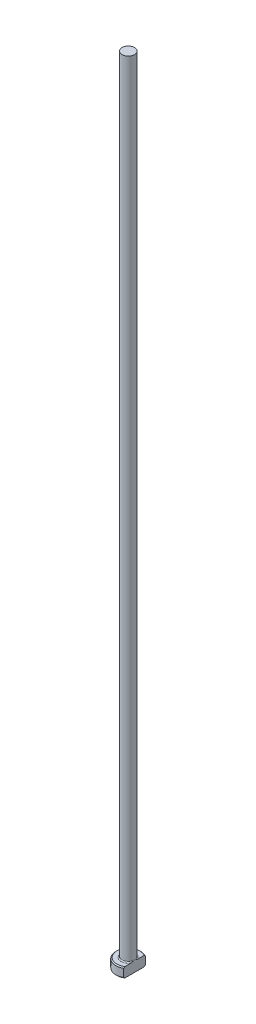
ISO-10303-21;
HEADER;
FILE_DESCRIPTION(('STEP AP214'),'2;1');
FILE_NAME('part.step','',(''),(''),'','','');
FILE_SCHEMA(('AUTOMOTIVE_DESIGN { 1 0 10303 214 1 1 1 1 }'));
ENDSEC;
DATA;
#1=APPLICATION_CONTEXT('core data for automotive mechanical design processes');
#2=APPLICATION_PROTOCOL_DEFINITION('international standard','automotive_design',2000,#1);
#3=PRODUCT_CONTEXT('',#1,'mechanical');
#4=PRODUCT('Part','Part','',(#3));
#5=PRODUCT_RELATED_PRODUCT_CATEGORY('part','',(#4));
#6=PRODUCT_DEFINITION_FORMATION('','',#4);
#7=PRODUCT_DEFINITION_CONTEXT('part definition',#1,'design');
#8=PRODUCT_DEFINITION('design','',#6,#7);
#9=PRODUCT_DEFINITION_SHAPE('','',#8);
#10=(LENGTH_UNIT() NAMED_UNIT(*) SI_UNIT(.MILLI.,.METRE.));
#11=(NAMED_UNIT(*) PLANE_ANGLE_UNIT() SI_UNIT($,.RADIAN.));
#12=(NAMED_UNIT(*) SI_UNIT($,.STERADIAN.) SOLID_ANGLE_UNIT());
#13=UNCERTAINTY_MEASURE_WITH_UNIT(LENGTH_MEASURE(1.E-05),#10,'distance_accuracy_value','');
#14=(GEOMETRIC_REPRESENTATION_CONTEXT(3) GLOBAL_UNCERTAINTY_ASSIGNED_CONTEXT((#13)) GLOBAL_UNIT_ASSIGNED_CONTEXT((#10,
#11,#12)) REPRESENTATION_CONTEXT('',''));
#15=CARTESIAN_POINT('',(0.,0.,0.));
#16=DIRECTION('',(0.,0.,1.));
#17=DIRECTION('',(1.,0.,0.));
#18=AXIS2_PLACEMENT_3D('',#15,#16,#17);
#19=CARTESIAN_POINT('',(0.,0.,0.));
#20=DIRECTION('',(0.,-1.,0.));
#21=DIRECTION('',(0.,0.,-1.));
#22=AXIS2_PLACEMENT_3D('',#19,#20,#21);
#23=PLANE('',#22);
#24=CARTESIAN_POINT('',(0.,0.,0.));
#25=DIRECTION('',(0.,-1.,0.));
#26=DIRECTION('',(0.,0.,-1.));
#27=AXIS2_PLACEMENT_3D('',#24,#25,#26);
#28=CIRCLE('',#27,2.29999999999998);
#29=CARTESIAN_POINT('',(1.24999999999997,0.,1.93067345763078));
#30=VERTEX_POINT('',#29);
#31=CARTESIAN_POINT('',(1.24999999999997,0.,-1.93067345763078));
#32=VERTEX_POINT('',#31);
#33=EDGE_CURVE('E98',#30,#32,#28,.T.);
#34=ORIENTED_EDGE('',*,*,#33,.T.);
#35=DIRECTION('',(0.,0.,1.));
#36=VECTOR('',#35,1.);
#37=CARTESIAN_POINT('',(1.24999999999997,0.,-2.16506350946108));
#38=LINE('',#37,#36);
#39=EDGE_CURVE('E83',#32,#30,#38,.T.);
#40=ORIENTED_EDGE('',*,*,#39,.T.);
#41=EDGE_LOOP('',(#34,#40));
#42=FACE_BOUND('',#41,.T.);
#43=ADVANCED_FACE('F32',(#42),#23,.T.);
#44=CARTESIAN_POINT('',(0.,259.958771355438,0.));
#45=DIRECTION('',(0.,1.,0.));
#46=DIRECTION('',(0.,0.,1.));
#47=AXIS2_PLACEMENT_3D('',#44,#45,#46);
#48=CYLINDRICAL_SURFACE('',#47,2.49999999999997);
#49=CARTESIAN_POINT('',(0.,1.79999999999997,0.));
#50=DIRECTION('',(0.,1.,0.));
#51=DIRECTION('',(0.,0.,1.));
#52=AXIS2_PLACEMENT_3D('',#49,#50,#51);
#53=CIRCLE('',#52,2.49999999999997);
#54=CARTESIAN_POINT('',(1.24999999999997,1.79999999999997,2.16506350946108));
#55=VERTEX_POINT('',#54);
#56=CARTESIAN_POINT('',(1.24999999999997,1.79999999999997,-2.16506350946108));
#57=VERTEX_POINT('',#56);
#58=EDGE_CURVE('E104',#55,#57,#53,.F.);
#59=ORIENTED_EDGE('',*,*,#58,.T.);
#60=DIRECTION('',(0.,-1.,0.));
#61=VECTOR('',#60,1.);
#62=CARTESIAN_POINT('',(1.24999999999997,160.,-2.16506350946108));
#63=LINE('',#62,#61);
#64=CARTESIAN_POINT('',(1.24999999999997,0.199999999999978,-2.16506350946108));
#65=VERTEX_POINT('',#64);
#66=EDGE_CURVE('E183',#57,#65,#63,.T.);
#67=ORIENTED_EDGE('',*,*,#66,.T.);
#68=CARTESIAN_POINT('',(0.,0.199999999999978,0.));
#69=DIRECTION('',(0.,-1.,0.));
#70=DIRECTION('',(0.,0.,-1.));
#71=AXIS2_PLACEMENT_3D('',#68,#69,#70);
#72=CIRCLE('',#71,2.49999999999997);
#73=CARTESIAN_POINT('',(1.24999999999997,0.199999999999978,2.16506350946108));
#74=VERTEX_POINT('',#73);
#75=EDGE_CURVE('E100',#65,#74,#72,.F.);
#76=ORIENTED_EDGE('',*,*,#75,.T.);
#77=DIRECTION('',(0.,-1.,0.));
#78=VECTOR('',#77,1.);
#79=CARTESIAN_POINT('',(1.24999999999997,160.,2.16506350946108));
#80=LINE('',#79,#78);
#81=EDGE_CURVE('E93',#55,#74,#80,.T.);
#82=ORIENTED_EDGE('',*,*,#81,.F.);
#83=EDGE_LOOP('',(#59,#67,#76,#82));
#84=FACE_BOUND('',#83,.T.);
#85=ADVANCED_FACE('F158',(#84),#48,.T.);
#86=CARTESIAN_POINT('',(-2.49999999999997,2.,0.));
#87=DIRECTION('',(0.,1.,0.));
#88=DIRECTION('',(0.,0.,1.));
#89=AXIS2_PLACEMENT_3D('',#86,#87,#88);
#90=PLANE('',#89);
#91=CARTESIAN_POINT('',(0.,2.,0.));
#92=DIRECTION('',(0.,1.,0.));
#93=DIRECTION('',(0.,0.,1.));
#94=AXIS2_PLACEMENT_3D('',#91,#92,#93);
#95=CIRCLE('',#94,2.29999999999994);
#96=CARTESIAN_POINT('',(1.24999999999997,2.,-1.93067345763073));
#97=VERTEX_POINT('',#96);
#98=CARTESIAN_POINT('',(1.24999999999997,2.,1.93067345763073));
#99=VERTEX_POINT('',#98);
#100=EDGE_CURVE('E178',#97,#99,#95,.T.);
#101=ORIENTED_EDGE('',*,*,#100,.T.);
#102=DIRECTION('',(0.,0.,-1.));
#103=VECTOR('',#102,1.);
#104=CARTESIAN_POINT('',(1.24999999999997,2.,0.));
#105=LINE('',#104,#103);
#106=CARTESIAN_POINT('',(1.24999999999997,1.99999999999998,0.73484692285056));
#107=VERTEX_POINT('',#106);
#108=EDGE_CURVE('E57',#99,#107,#105,.T.);
#109=ORIENTED_EDGE('',*,*,#108,.T.);
#110=CARTESIAN_POINT('',(0.,2.,0.));
#111=DIRECTION('',(0.,1.,0.));
#112=DIRECTION('',(0.,0.,1.));
#113=AXIS2_PLACEMENT_3D('',#110,#111,#112);
#114=CIRCLE('',#113,1.44999999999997);
#115=CARTESIAN_POINT('',(1.24999999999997,1.99999999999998,-0.734846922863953));
#116=VERTEX_POINT('',#115);
#117=EDGE_CURVE('E107',#107,#116,#114,.F.);
#118=ORIENTED_EDGE('',*,*,#117,.T.);
#119=EDGE_CURVE('E136',#116,#97,#105,.T.);
#120=ORIENTED_EDGE('',*,*,#119,.T.);
#121=EDGE_LOOP('',(#101,#109,#118,#120));
#122=FACE_BOUND('',#121,.T.);
#123=ADVANCED_FACE('F147',(#122),#90,.T.);
#124=CARTESIAN_POINT('',(0.,2.,0.));
#125=DIRECTION('',(0.,-1.,0.));
#126=DIRECTION('',(0.,0.,-1.));
#127=AXIS2_PLACEMENT_3D('',#124,#125,#126);
#128=CONICAL_SURFACE('',#127,2.29999999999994,0.785398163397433);
#129=ORIENTED_EDGE('',*,*,#58,.F.);
#130=CARTESIAN_POINT('',(1.24999999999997,-0.627301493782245,4.76610952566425));
#131=CARTESIAN_POINT('',(1.24999999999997,-0.522786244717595,4.6580533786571));
#132=CARTESIAN_POINT('',(1.24999999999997,-0.418383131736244,4.54988840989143));
#133=CARTESIAN_POINT('',(1.24999999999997,-0.209867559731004,4.33327605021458));
#134=CARTESIAN_POINT('',(1.24999999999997,-0.105755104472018,4.22482865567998));
#135=CARTESIAN_POINT('',(1.24999999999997,0.102163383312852,4.00753373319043));
#136=CARTESIAN_POINT('',(1.24999999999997,0.205969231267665,3.89868602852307));
#137=CARTESIAN_POINT('',(1.24999999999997,0.413121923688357,3.68055575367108));
#138=CARTESIAN_POINT('',(1.24999999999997,0.516468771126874,3.57127318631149));
#139=CARTESIAN_POINT('',(1.24999999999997,0.72052253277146,3.35432408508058));
#140=CARTESIAN_POINT('',(1.24999999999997,0.821241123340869,3.24666854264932));
#141=CARTESIAN_POINT('',(1.24999999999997,1.02192410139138,3.03065701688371));
#142=CARTESIAN_POINT('',(1.24999999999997,1.12188849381,2.92230103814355));
#143=CARTESIAN_POINT('',(1.24999999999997,1.32077037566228,2.70467415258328));
#144=CARTESIAN_POINT('',(1.24999999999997,1.41968808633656,2.59540344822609));
#145=CARTESIAN_POINT('',(1.24999999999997,1.61608273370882,2.37557697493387));
#146=CARTESIAN_POINT('',(1.24999999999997,1.71355972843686,2.26502125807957));
#147=CARTESIAN_POINT('',(1.24999999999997,1.86911393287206,2.08515617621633));
#148=CARTESIAN_POINT('',(1.24999999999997,1.92785594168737,2.01642247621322));
#149=CARTESIAN_POINT('',(1.24999999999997,2.04429378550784,1.8780605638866));
#150=CARTESIAN_POINT('',(1.24999999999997,2.10198951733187,1.80843226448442));
#151=CARTESIAN_POINT('',(1.24999999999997,2.21658041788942,1.66728976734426));
#152=CARTESIAN_POINT('',(1.24999999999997,2.27346067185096,1.59576341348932));
#153=CARTESIAN_POINT('',(1.24999999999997,2.38522965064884,1.45118948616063));
#154=CARTESIAN_POINT('',(1.24999999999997,2.44011885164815,1.37814228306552));
#155=CARTESIAN_POINT('',(1.24999999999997,2.54788773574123,1.22886697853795));
#156=CARTESIAN_POINT('',(1.24999999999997,2.60072420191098,1.15260740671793));
#157=CARTESIAN_POINT('',(1.24999999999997,2.70212030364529,0.997098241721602));
#158=CARTESIAN_POINT('',(1.24999999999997,2.75067405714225,0.917844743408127));
#159=CARTESIAN_POINT('',(1.24999999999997,2.84043729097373,0.756494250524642));
#160=CARTESIAN_POINT('',(1.24999999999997,2.88173033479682,0.674444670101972));
#161=CARTESIAN_POINT('',(1.24999999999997,2.95366083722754,0.505835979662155));
#162=CARTESIAN_POINT('',(1.24999999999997,2.98433405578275,0.419293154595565));
#163=CARTESIAN_POINT('',(1.24999999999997,3.01753107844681,0.289507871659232));
#164=CARTESIAN_POINT('',(1.24999999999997,3.02633539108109,0.247870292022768));
#165=CARTESIAN_POINT('',(1.24999999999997,3.03997448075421,0.163937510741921));
#166=CARTESIAN_POINT('',(1.24999999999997,3.04480960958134,0.121642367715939));
#167=CARTESIAN_POINT('',(1.24999999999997,3.05016786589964,0.0369068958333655));
#168=CARTESIAN_POINT('',(1.24999999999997,3.05070431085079,-0.00553257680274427));
#169=CARTESIAN_POINT('',(1.24999999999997,3.04746162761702,-0.0902467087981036));
#170=CARTESIAN_POINT('',(1.24999999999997,3.04368214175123,-0.132521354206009));
#171=CARTESIAN_POINT('',(1.24999999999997,3.03212264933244,-0.216135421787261));
#172=CARTESIAN_POINT('',(1.24999999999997,3.02437758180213,-0.257479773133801));
#173=CARTESIAN_POINT('',(1.24999999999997,3.0053673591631,-0.33935443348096));
#174=CARTESIAN_POINT('',(1.24999999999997,2.99410082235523,-0.379884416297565));
#175=CARTESIAN_POINT('',(1.24999999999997,2.96852211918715,-0.460209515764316));
#176=CARTESIAN_POINT('',(1.24999999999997,2.95419322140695,-0.49999923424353));
#177=CARTESIAN_POINT('',(1.24999999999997,2.92306392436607,-0.578577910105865));
#178=CARTESIAN_POINT('',(1.24999999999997,2.9062640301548,-0.617367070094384));
#179=CARTESIAN_POINT('',(1.24999999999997,2.85269034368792,-0.732719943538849));
#180=CARTESIAN_POINT('',(1.24999999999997,2.81287978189,-0.807869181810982));
#181=CARTESIAN_POINT('',(1.24999999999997,2.72799210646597,-0.955157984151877));
#182=CARTESIAN_POINT('',(1.24999999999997,2.68290855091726,-1.02729371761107));
#183=CARTESIAN_POINT('',(1.24999999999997,2.58903993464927,-1.16950551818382));
#184=CARTESIAN_POINT('',(1.24999999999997,2.54024093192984,-1.23957230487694));
#185=CARTESIAN_POINT('',(1.24999999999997,2.44021824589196,-1.37788366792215));
#186=CARTESIAN_POINT('',(1.24999999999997,2.38899576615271,-1.44612912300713));
#187=CARTESIAN_POINT('',(1.24999999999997,2.28411092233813,-1.58215279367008));
#188=CARTESIAN_POINT('',(1.24999999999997,2.23042529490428,-1.64991298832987));
#189=CARTESIAN_POINT('',(1.24999999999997,2.12172412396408,-1.7843605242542));
#190=CARTESIAN_POINT('',(1.24999999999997,2.06670849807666,-1.85104779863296));
#191=CARTESIAN_POINT('',(1.24999999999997,1.90044437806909,-2.04954410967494));
#192=CARTESIAN_POINT('',(1.24999999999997,1.78772044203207,-2.1801152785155));
#193=CARTESIAN_POINT('',(1.24999999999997,1.57927088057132,-2.41711311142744));
#194=CARTESIAN_POINT('',(1.24999999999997,1.48391557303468,-2.52386864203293));
#195=CARTESIAN_POINT('',(1.24999999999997,1.29202937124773,-2.73632311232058));
#196=CARTESIAN_POINT('',(1.24999999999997,1.19549844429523,-2.84202202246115));
#197=CARTESIAN_POINT('',(1.24999999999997,0.904469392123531,-3.15815976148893));
#198=CARTESIAN_POINT('',(1.24999999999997,0.70871394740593,-3.36743889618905));
#199=CARTESIAN_POINT('',(1.24999999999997,0.323382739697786,-3.77561196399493));
#200=CARTESIAN_POINT('',(1.24999999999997,0.133884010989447,-3.97457897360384));
#201=CARTESIAN_POINT('',(1.24999999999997,-0.151120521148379,-4.27209258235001));
#202=CARTESIAN_POINT('',(1.24999999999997,-0.246194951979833,-4.37105278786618));
#203=CARTESIAN_POINT('',(1.24999999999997,-0.436581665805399,-4.56874260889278));
#204=CARTESIAN_POINT('',(1.24999999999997,-0.531893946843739,-4.66747222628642));
#205=CARTESIAN_POINT('',(1.24999999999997,-0.627301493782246,-4.76610952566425));
#206=B_SPLINE_CURVE_WITH_KNOTS('',3,(#130,#131,#132,#133,#134,#135,#136,#137,#138,#139,#140,
#141,#142,#143,#144,#145,#146,#147,#148,#149,#150,#151,#152,#153,#154,#155,#156,#157,#158,#159,
#160,#161,#162,#163,#164,#165,#166,#167,#168,#169,#170,#171,#172,#173,#174,#175,#176,#177,#178,
#179,#180,#181,#182,#183,#184,#185,#186,#187,#188,#189,#190,#191,#192,#193,#194,#195,#196,#197,
#198,#199,#200,#201,#202,#203,#204,#205),.UNSPECIFIED.,.F.,.F.,(4,2,2,2,2,2,2,2,2,2,2,2,2,2,2,2,
2,2,2,2,2,2,2,2,2,2,2,2,2,2,2,2,2,2,2,2,2,4),(0.,0.450994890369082,0.901995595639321,
1.35322763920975,1.80445675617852,2.24672733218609,2.6889950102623,3.1311672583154,
3.57332164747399,3.8445601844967,4.11582532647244,4.38995864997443,4.66402597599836,
4.94225842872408,5.22086725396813,5.49602313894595,5.77024327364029,5.89775644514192,
6.02525831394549,6.15236502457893,6.27948226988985,6.40549833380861,6.531563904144,
6.65833670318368,6.78508362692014,7.03983854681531,7.2949080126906,7.55098686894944,
7.80693985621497,8.06626716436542,8.32561057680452,8.84304654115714,9.27246240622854,
9.70189024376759,10.5615524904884,11.385852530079,11.7975442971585,12.2092326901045),.UNSPECIFIED.);
#207=EDGE_CURVE('E135',#55,#99,#206,.T.);
#208=ORIENTED_EDGE('',*,*,#207,.T.);
#209=ORIENTED_EDGE('',*,*,#100,.F.);
#210=EDGE_CURVE('E127',#97,#57,#206,.T.);
#211=ORIENTED_EDGE('',*,*,#210,.T.);
#212=EDGE_LOOP('',(#129,#208,#209,#211));
#213=FACE_BOUND('',#212,.T.);
#214=ADVANCED_FACE('F143',(#213),#128,.T.);
#215=CARTESIAN_POINT('',(0.,0.199999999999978,0.));
#216=DIRECTION('',(0.,1.,0.));
#217=DIRECTION('',(0.,0.,1.));
#218=AXIS2_PLACEMENT_3D('',#215,#216,#217);
#219=CONICAL_SURFACE('',#218,2.49999999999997,0.785398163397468);
#220=ORIENTED_EDGE('',*,*,#75,.F.);
#221=CARTESIAN_POINT('',(1.24999999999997,2.62730149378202,-4.76610952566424));
#222=CARTESIAN_POINT('',(1.24999999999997,2.52278624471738,-4.65805337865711));
#223=CARTESIAN_POINT('',(1.24999999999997,2.41838313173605,-4.54988840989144));
#224=CARTESIAN_POINT('',(1.24999999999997,2.20986755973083,-4.3332760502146));
#225=CARTESIAN_POINT('',(1.24999999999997,2.10575510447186,-4.22482865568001));
#226=CARTESIAN_POINT('',(1.24999999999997,1.89783661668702,-4.00753373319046));
#227=CARTESIAN_POINT('',(1.24999999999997,1.79403076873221,-3.89868602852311));
#228=CARTESIAN_POINT('',(1.24999999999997,1.58687807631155,-3.68055575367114));
#229=CARTESIAN_POINT('',(1.24999999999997,1.48353122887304,-3.57127318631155));
#230=CARTESIAN_POINT('',(1.24999999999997,1.27947746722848,-3.35432408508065));
#231=CARTESIAN_POINT('',(1.24999999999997,1.17875887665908,-3.2466685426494));
#232=CARTESIAN_POINT('',(1.24999999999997,0.978075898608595,-3.0306570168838));
#233=CARTESIAN_POINT('',(1.24999999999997,0.878111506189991,-2.92230103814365));
#234=CARTESIAN_POINT('',(1.24999999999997,0.679229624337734,-2.70467415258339));
#235=CARTESIAN_POINT('',(1.24999999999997,0.580311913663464,-2.5954034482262));
#236=CARTESIAN_POINT('',(1.24999999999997,0.383917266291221,-2.375576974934));
#237=CARTESIAN_POINT('',(1.24999999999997,0.28644027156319,-2.2650212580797));
#238=CARTESIAN_POINT('',(1.24999999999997,0.130886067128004,-2.08515617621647));
#239=CARTESIAN_POINT('',(1.24999999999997,0.0721440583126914,-2.01642247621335));
#240=CARTESIAN_POINT('',(1.24999999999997,-0.0442937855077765,-1.87806056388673));
#241=CARTESIAN_POINT('',(1.24999999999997,-0.101989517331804,-1.80843226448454));
#242=CARTESIAN_POINT('',(1.24999999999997,-0.216580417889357,-1.66728976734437));
#243=CARTESIAN_POINT('',(1.24999999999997,-0.273460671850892,-1.59576341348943));
#244=CARTESIAN_POINT('',(1.24999999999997,-0.385229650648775,-1.45118948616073));
#245=CARTESIAN_POINT('',(1.24999999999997,-0.440118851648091,-1.37814228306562));
#246=CARTESIAN_POINT('',(1.24999999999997,-0.547887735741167,-1.22886697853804));
#247=CARTESIAN_POINT('',(1.24999999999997,-0.600724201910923,-1.15260740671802));
#248=CARTESIAN_POINT('',(1.24999999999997,-0.702120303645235,-0.997098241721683));
#249=CARTESIAN_POINT('',(1.24999999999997,-0.750674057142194,-0.917844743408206));
#250=CARTESIAN_POINT('',(1.24999999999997,-0.840437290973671,-0.756494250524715));
#251=CARTESIAN_POINT('',(1.24999999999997,-0.881730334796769,-0.674444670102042));
#252=CARTESIAN_POINT('',(1.24999999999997,-0.953660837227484,-0.505835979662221));
#253=CARTESIAN_POINT('',(1.24999999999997,-0.984334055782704,-0.419293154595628));
#254=CARTESIAN_POINT('',(1.24999999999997,-1.01753107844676,-0.289507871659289));
#255=CARTESIAN_POINT('',(1.24999999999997,-1.02633539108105,-0.247870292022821));
#256=CARTESIAN_POINT('',(1.24999999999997,-1.03997448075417,-0.163937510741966));
#257=CARTESIAN_POINT('',(1.24999999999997,-1.0448096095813,-0.121642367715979));
#258=CARTESIAN_POINT('',(1.24999999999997,-1.05016786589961,-0.0369068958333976));
#259=CARTESIAN_POINT('',(1.24999999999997,-1.05070431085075,0.00553257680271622));
#260=CARTESIAN_POINT('',(1.24999999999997,-1.04746162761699,0.0902467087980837));
#261=CARTESIAN_POINT('',(1.24999999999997,-1.0436821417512,0.132521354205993));
#262=CARTESIAN_POINT('',(1.24999999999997,-1.03212264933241,0.216135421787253));
#263=CARTESIAN_POINT('',(1.24999999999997,-1.0243775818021,0.257479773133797));
#264=CARTESIAN_POINT('',(1.24999999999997,-1.00536735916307,0.339354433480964));
#265=CARTESIAN_POINT('',(1.24999999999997,-0.994100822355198,0.379884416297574));
#266=CARTESIAN_POINT('',(1.24999999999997,-0.968522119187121,0.460209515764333));
#267=CARTESIAN_POINT('',(1.24999999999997,-0.954193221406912,0.499999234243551));
#268=CARTESIAN_POINT('',(1.24999999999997,-0.92306392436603,0.578577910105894));
#269=CARTESIAN_POINT('',(1.24999999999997,-0.906264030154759,0.617367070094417));
#270=CARTESIAN_POINT('',(1.24999999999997,-0.852690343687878,0.732719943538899));
#271=CARTESIAN_POINT('',(1.24999999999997,-0.812879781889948,0.807869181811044));
#272=CARTESIAN_POINT('',(1.24999999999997,-0.727992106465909,0.955157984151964));
#273=CARTESIAN_POINT('',(1.24999999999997,-0.682908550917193,1.02729371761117));
#274=CARTESIAN_POINT('',(1.24999999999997,-0.589039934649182,1.16950551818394));
#275=CARTESIAN_POINT('',(1.24999999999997,-0.540240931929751,1.23957230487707));
#276=CARTESIAN_POINT('',(1.24999999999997,-0.440218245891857,1.3778836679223));
#277=CARTESIAN_POINT('',(1.24999999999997,-0.388995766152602,1.44612912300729));
#278=CARTESIAN_POINT('',(1.24999999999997,-0.284110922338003,1.58215279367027));
#279=CARTESIAN_POINT('',(1.24999999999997,-0.230425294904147,1.64991298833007));
#280=CARTESIAN_POINT('',(1.24999999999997,-0.121724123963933,1.78436052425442));
#281=CARTESIAN_POINT('',(1.24999999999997,-0.0667084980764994,1.8510477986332));
#282=CARTESIAN_POINT('',(1.24999999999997,0.0995556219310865,2.0495441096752));
#283=CARTESIAN_POINT('',(1.24999999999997,0.212279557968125,2.18011527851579));
#284=CARTESIAN_POINT('',(1.24999999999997,0.420729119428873,2.41711311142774));
#285=CARTESIAN_POINT('',(1.24999999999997,0.516084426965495,2.5238686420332));
#286=CARTESIAN_POINT('',(1.24999999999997,0.707970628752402,2.73632311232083));
#287=CARTESIAN_POINT('',(1.24999999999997,0.80450155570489,2.84202202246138));
#288=CARTESIAN_POINT('',(1.24999999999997,1.09553060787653,3.15815976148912));
#289=CARTESIAN_POINT('',(1.24999999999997,1.29128605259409,3.36743889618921));
#290=CARTESIAN_POINT('',(1.24999999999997,1.67661726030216,3.77561196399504));
#291=CARTESIAN_POINT('',(1.24999999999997,1.86611598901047,3.97457897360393));
#292=CARTESIAN_POINT('',(1.24999999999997,2.15112052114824,4.27209258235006));
#293=CARTESIAN_POINT('',(1.24999999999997,2.24619495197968,4.37105278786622));
#294=CARTESIAN_POINT('',(1.24999999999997,2.43658166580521,4.5687426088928));
#295=CARTESIAN_POINT('',(1.24999999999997,2.53189394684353,4.66747222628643));
#296=CARTESIAN_POINT('',(1.24999999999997,2.62730149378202,4.76610952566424));
#297=B_SPLINE_CURVE_WITH_KNOTS('',3,(#221,#222,#223,#224,#225,#226,#227,#228,#229,#230,#231,
#232,#233,#234,#235,#236,#237,#238,#239,#240,#241,#242,#243,#244,#245,#246,#247,#248,#249,#250,
#251,#252,#253,#254,#255,#256,#257,#258,#259,#260,#261,#262,#263,#264,#265,#266,#267,#268,#269,
#270,#271,#272,#273,#274,#275,#276,#277,#278,#279,#280,#281,#282,#283,#284,#285,#286,#287,#288,
#289,#290,#291,#292,#293,#294,#295,#296),.UNSPECIFIED.,.F.,.F.,(4,2,2,2,2,2,2,2,2,2,2,2,2,2,2,2,
2,2,2,2,2,2,2,2,2,2,2,2,2,2,2,2,2,2,2,2,2,4),(0.,0.450994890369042,0.901995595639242,
1.35322763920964,1.80445675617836,2.2467273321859,2.68899501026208,3.13116725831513,
3.57332164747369,3.84456018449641,4.11582532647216,4.38995864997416,4.66402597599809,
4.94225842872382,5.22086725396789,5.49602313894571,5.77024327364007,5.89775644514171,
6.02525831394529,6.15236502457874,6.27948226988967,6.40549833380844,6.53156390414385,
6.65833670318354,6.78508362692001,7.03983854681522,7.29490801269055,7.55098686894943,
7.806939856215,8.06626716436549,8.32561057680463,8.84304654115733,9.27246240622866,
9.70189024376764,10.5615524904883,11.3858525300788,11.7975442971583,12.2092326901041),.UNSPECIFIED.);
#298=EDGE_CURVE('E86',#65,#32,#297,.T.);
#299=ORIENTED_EDGE('',*,*,#298,.T.);
#300=ORIENTED_EDGE('',*,*,#33,.F.);
#301=EDGE_CURVE('E89',#30,#74,#297,.T.);
#302=ORIENTED_EDGE('',*,*,#301,.T.);
#303=EDGE_LOOP('',(#220,#299,#300,#302));
#304=FACE_BOUND('',#303,.T.);
#305=ADVANCED_FACE('F97',(#304),#219,.T.);
#306=CARTESIAN_POINT('',(0.,2.19999999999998,0.));
#307=DIRECTION('',(0.,1.,0.));
#308=DIRECTION('',(0.,0.,1.));
#309=AXIS2_PLACEMENT_3D('',#306,#307,#308);
#310=TOROIDAL_SURFACE('',#309,1.44999999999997,0.2);
#311=CARTESIAN_POINT('',(1.24999999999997,2.19999999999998,0.));
#312=CARTESIAN_POINT('',(1.24999999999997,2.20000051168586,-1.9767961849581E-10));
#313=CARTESIAN_POINT('',(1.24999999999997,2.20000102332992,-1.08908063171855E-07));
#314=CARTESIAN_POINT('',(1.24999999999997,2.20000200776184,-4.52594759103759E-07));
#315=CARTESIAN_POINT('',(1.24999999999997,2.20000247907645,-6.90993033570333E-07));
#316=CARTESIAN_POINT('',(1.24999999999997,2.20000341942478,-1.26357942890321E-06));
#317=CARTESIAN_POINT('',(1.24999999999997,2.20000388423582,-1.60457617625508E-06));
#318=CARTESIAN_POINT('',(1.24999999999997,2.20000476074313,-2.3395489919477E-06));
#319=CARTESIAN_POINT('',(1.24999999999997,2.20000517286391,-2.7330414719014E-06));
#320=CARTESIAN_POINT('',(1.24999999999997,2.20000655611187,-4.14544010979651E-06));
#321=CARTESIAN_POINT('',(1.24999999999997,2.20000745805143,-5.23310089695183E-06));
#322=CARTESIAN_POINT('',(1.24999999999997,2.20000906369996,-7.47950358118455E-06));
#323=CARTESIAN_POINT('',(1.24999999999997,2.20000977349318,-8.63414435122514E-06));
#324=CARTESIAN_POINT('',(1.24999999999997,2.20001244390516,-1.31453476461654E-05));
#325=CARTESIAN_POINT('',(1.24999999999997,2.20001426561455,-1.65880555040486E-05));
#326=CARTESIAN_POINT('',(1.24999999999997,2.20001724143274,-2.33729028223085E-05));
#327=CARTESIAN_POINT('',(1.24999999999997,2.20001844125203,-2.66956153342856E-05));
#328=CARTESIAN_POINT('',(1.24999999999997,2.2000235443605,-4.08635084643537E-05));
#329=CARTESIAN_POINT('',(1.24999999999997,2.20002741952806,-5.17114612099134E-05));
#330=CARTESIAN_POINT('',(1.24999999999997,2.20003363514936,-7.20057670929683E-05));
#331=CARTESIAN_POINT('',(1.24999999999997,2.20003612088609,-8.14057063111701E-05));
#332=CARTESIAN_POINT('',(1.24999999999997,2.20005581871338,-0.000149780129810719));
#333=CARTESIAN_POINT('',(1.24999999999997,2.20008094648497,-0.000206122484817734));
#334=CARTESIAN_POINT('',(1.24999999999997,2.20017507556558,-0.000425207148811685));
#335=CARTESIAN_POINT('',(1.24999999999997,2.20023819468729,-0.000589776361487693));
#336=CARTESIAN_POINT('',(1.24999999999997,2.20048692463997,-0.00122878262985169));
#337=CARTESIAN_POINT('',(1.24999999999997,2.20067870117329,-0.00170134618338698));
#338=CARTESIAN_POINT('',(1.24999999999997,2.20146022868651,-0.00363636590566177));
#339=CARTESIAN_POINT('',(1.24999999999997,2.20204298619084,-0.00510090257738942));
#340=CARTESIAN_POINT('',(1.24999999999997,2.20939719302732,-0.0235712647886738));
#341=CARTESIAN_POINT('',(1.24999999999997,2.21621259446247,-0.0405643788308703));
#342=CARTESIAN_POINT('',(1.24999999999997,2.22951000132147,-0.0739606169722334));
#343=CARTESIAN_POINT('',(1.24999999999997,2.23599508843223,-0.0903626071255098));
#344=CARTESIAN_POINT('',(1.24999999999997,2.24961430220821,-0.12511129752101));
#345=CARTESIAN_POINT('',(1.24999999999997,2.25673641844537,-0.143462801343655));
#346=CARTESIAN_POINT('',(1.24999999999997,2.27085039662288,-0.180427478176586));
#347=CARTESIAN_POINT('',(1.24999999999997,2.27784022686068,-0.199041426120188));
#348=CARTESIAN_POINT('',(1.24999999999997,2.29479134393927,-0.245221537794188));
#349=CARTESIAN_POINT('',(1.24999999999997,2.30459026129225,-0.272848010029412));
#350=CARTESIAN_POINT('',(1.24999999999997,2.32310234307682,-0.327738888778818));
#351=CARTESIAN_POINT('',(1.24999999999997,2.33183568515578,-0.354996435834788));
#352=CARTESIAN_POINT('',(1.24999999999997,2.3493656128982,-0.41374417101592));
#353=CARTESIAN_POINT('',(1.24999999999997,2.35799470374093,-0.445285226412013));
#354=CARTESIAN_POINT('',(1.24999999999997,2.37338463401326,-0.509091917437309));
#355=CARTESIAN_POINT('',(1.24999999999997,2.38013036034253,-0.541361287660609));
#356=CARTESIAN_POINT('',(1.24999999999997,2.39136059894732,-0.608339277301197));
#357=CARTESIAN_POINT('',(1.24999999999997,2.39568167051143,-0.643076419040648));
#358=CARTESIAN_POINT('',(1.24999999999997,2.40037605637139,-0.712733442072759));
#359=CARTESIAN_POINT('',(1.24999999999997,2.40076553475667,-0.747651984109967));
#360=CARTESIAN_POINT('',(1.24999999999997,2.39677668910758,-0.8081037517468));
#361=CARTESIAN_POINT('',(1.24999999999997,2.39361441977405,-0.833711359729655));
#362=CARTESIAN_POINT('',(1.24999999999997,2.38355990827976,-0.883915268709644));
#363=CARTESIAN_POINT('',(1.24999999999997,2.37671813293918,-0.908520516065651));
#364=CARTESIAN_POINT('',(1.24999999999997,2.36252570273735,-0.944879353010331));
#365=CARTESIAN_POINT('',(1.24999999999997,2.35688428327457,-0.957298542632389));
#366=CARTESIAN_POINT('',(1.24999999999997,2.34399066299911,-0.981318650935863));
#367=CARTESIAN_POINT('',(1.24999999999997,2.33673636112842,-0.992918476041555));
#368=CARTESIAN_POINT('',(1.24999999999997,2.32199744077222,-1.01267533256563));
#369=CARTESIAN_POINT('',(1.24999999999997,2.31482723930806,-1.02106482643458));
#370=CARTESIAN_POINT('',(1.24999999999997,2.29924321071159,-1.03659690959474));
#371=CARTESIAN_POINT('',(1.24999999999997,2.29083198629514,-1.04374204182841));
#372=CARTESIAN_POINT('',(1.24999999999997,2.27498600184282,-1.05478694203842));
#373=CARTESIAN_POINT('',(1.24999999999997,2.26780814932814,-1.05905359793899));
#374=CARTESIAN_POINT('',(1.24999999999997,2.25284782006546,-1.06635953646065));
#375=CARTESIAN_POINT('',(1.24999999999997,2.24506572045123,-1.06939957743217));
#376=CARTESIAN_POINT('',(1.24999999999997,2.22901828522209,-1.07404931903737));
#377=CARTESIAN_POINT('',(1.24999999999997,2.22074990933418,-1.07564870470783));
#378=CARTESIAN_POINT('',(1.24999999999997,2.20405985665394,-1.07723717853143));
#379=CARTESIAN_POINT('',(1.24999999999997,2.19563825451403,-1.07722703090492));
#380=CARTESIAN_POINT('',(1.24999999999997,2.17988128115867,-1.07569157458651));
#381=CARTESIAN_POINT('',(1.24999999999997,2.17252879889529,-1.0743339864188));
#382=CARTESIAN_POINT('',(1.24999999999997,2.15814333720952,-1.07044616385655));
#383=CARTESIAN_POINT('',(1.24999999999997,2.15111040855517,-1.06791574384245));
#384=CARTESIAN_POINT('',(1.24999999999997,2.13724955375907,-1.06171920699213));
#385=CARTESIAN_POINT('',(1.24999999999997,2.13043935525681,-1.05801386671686));
#386=CARTESIAN_POINT('',(1.24999999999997,2.11740316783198,-1.04969609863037));
#387=CARTESIAN_POINT('',(1.24999999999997,2.11117742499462,-1.04508329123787));
#388=CARTESIAN_POINT('',(1.24999999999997,2.09586196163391,-1.03220341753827));
#389=CARTESIAN_POINT('',(1.24999999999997,2.08723799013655,-1.02338140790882));
#390=CARTESIAN_POINT('',(1.24999999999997,2.07148817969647,-1.00448021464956));
#391=CARTESIAN_POINT('',(1.24999999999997,2.0643671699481,-0.994397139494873));
#392=CARTESIAN_POINT('',(1.24999999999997,2.04800089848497,-0.967694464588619));
#393=CARTESIAN_POINT('',(1.24999999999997,2.0397014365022,-0.950498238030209));
#394=CARTESIAN_POINT('',(1.24999999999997,2.02582422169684,-0.915117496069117));
#395=CARTESIAN_POINT('',(1.24999999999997,2.02024415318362,-0.896933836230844));
#396=CARTESIAN_POINT('',(1.24999999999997,2.00805724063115,-0.846781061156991));
#397=CARTESIAN_POINT('',(1.24999999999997,2.00359525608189,-0.8142976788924));
#398=CARTESIAN_POINT('',(1.24999999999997,1.99933348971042,-0.748574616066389));
#399=CARTESIAN_POINT('',(1.24999999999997,1.99961552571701,-0.715331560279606));
#400=CARTESIAN_POINT('',(1.24999999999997,2.00446632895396,-0.637920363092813));
#401=CARTESIAN_POINT('',(1.24999999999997,2.01044886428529,-0.593849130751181));
#402=CARTESIAN_POINT('',(1.24999999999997,2.02681929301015,-0.506401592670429));
#403=CARTESIAN_POINT('',(1.24999999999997,2.03722697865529,-0.463029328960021));
#404=CARTESIAN_POINT('',(1.24999999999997,2.06007158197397,-0.380638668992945));
#405=CARTESIAN_POINT('',(1.24999999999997,2.07227412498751,-0.34155342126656));
#406=CARTESIAN_POINT('',(1.24999999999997,2.09824323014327,-0.264347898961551));
#407=CARTESIAN_POINT('',(1.24999999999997,2.11199311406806,-0.226221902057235));
#408=CARTESIAN_POINT('',(1.24999999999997,2.13108825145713,-0.175350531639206));
#409=CARTESIAN_POINT('',(1.24999999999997,2.13599999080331,-0.16243890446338));
#410=CARTESIAN_POINT('',(1.24999999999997,2.14604281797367,-0.13631825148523));
#411=CARTESIAN_POINT('',(1.24999999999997,2.15117629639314,-0.123110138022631));
#412=CARTESIAN_POINT('',(1.24999999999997,2.16341702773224,-0.0918425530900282));
#413=CARTESIAN_POINT('',(1.24999999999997,2.17055250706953,-0.0737943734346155));
#414=CARTESIAN_POINT('',(1.24999999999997,2.18426943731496,-0.0393586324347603));
#415=CARTESIAN_POINT('',(1.24999999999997,2.19084281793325,-0.0229681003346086));
#416=CARTESIAN_POINT('',(1.24999999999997,2.19795564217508,-0.00510438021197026));
#417=CARTESIAN_POINT('',(1.24999999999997,2.19853702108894,-0.00364331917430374));
#418=CARTESIAN_POINT('',(1.24999999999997,2.19931818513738,-0.00170914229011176));
#419=CARTESIAN_POINT('',(1.24999999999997,2.19951102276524,-0.00123396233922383));
#420=CARTESIAN_POINT('',(1.24999999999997,2.19976104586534,-0.000591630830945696));
#421=CARTESIAN_POINT('',(1.24999999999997,2.19982443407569,-0.000426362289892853));
#422=CARTESIAN_POINT('',(1.24999999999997,2.1999189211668,-0.000206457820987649));
#423=CARTESIAN_POINT('',(1.24999999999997,2.19994410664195,-0.000149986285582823));
#424=CARTESIAN_POINT('',(1.24999999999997,2.19996383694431,-8.1464748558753E-05));
#425=CARTESIAN_POINT('',(1.24999999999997,2.19996632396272,-7.20551566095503E-05));
#426=CARTESIAN_POINT('',(1.24999999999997,2.19997254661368,-5.17396175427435E-05));
#427=CARTESIAN_POINT('',(1.24999999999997,2.19997642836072,-4.08803462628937E-05));
#428=CARTESIAN_POINT('',(1.24999999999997,2.19998153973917,-2.66997572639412E-05));
#429=CARTESIAN_POINT('',(1.24999999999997,2.1999827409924,-2.33755457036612E-05));
#430=CARTESIAN_POINT('',(1.24999999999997,2.19998572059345,-1.65878757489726E-05));
#431=CARTESIAN_POINT('',(1.24999999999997,2.19998754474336,-1.31438993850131E-05));
#432=CARTESIAN_POINT('',(1.24999999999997,2.19999021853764,-8.63150510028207E-06));
#433=CARTESIAN_POINT('',(1.24999999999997,2.19999092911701,-7.47674879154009E-06));
#434=CARTESIAN_POINT('',(1.24999999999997,2.19999253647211,-5.23027079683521E-06));
#435=CARTESIAN_POINT('',(1.24999999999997,2.19999343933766,-4.14265820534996E-06));
#436=CARTESIAN_POINT('',(1.24999999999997,2.19999482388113,-2.73051190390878E-06));
#437=CARTESIAN_POINT('',(1.24999999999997,2.19999523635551,-2.33712918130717E-06));
#438=CARTESIAN_POINT('',(1.24999999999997,2.19999611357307,-1.60243917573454E-06));
#439=CARTESIAN_POINT('',(1.24999999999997,2.19999657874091,-1.26161620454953E-06));
#440=CARTESIAN_POINT('',(1.24999999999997,2.19999751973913,-6.89449591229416E-07));
#441=CARTESIAN_POINT('',(1.24999999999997,2.19999799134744,-4.51288697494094E-07));
#442=CARTESIAN_POINT('',(1.24999999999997,2.19999897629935,-1.08178109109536E-07));
#443=CARTESIAN_POINT('',(1.24999999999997,2.19999948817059,1.97735059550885E-10));
#444=CARTESIAN_POINT('',(1.24999999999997,2.19999999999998,0.));
#445=B_SPLINE_CURVE_WITH_KNOTS('',3,(#311,#312,#313,#314,#315,#316,#317,#318,#319,#320,#321,
#322,#323,#324,#325,#326,#327,#328,#329,#330,#331,#332,#333,#334,#335,#336,#337,#338,#339,#340,
#341,#342,#343,#344,#345,#346,#347,#348,#349,#350,#351,#352,#353,#354,#355,#356,#357,#358,#359,
#360,#361,#362,#363,#364,#365,#366,#367,#368,#369,#370,#371,#372,#373,#374,#375,#376,#377,#378,
#379,#380,#381,#382,#383,#384,#385,#386,#387,#388,#389,#390,#391,#392,#393,#394,#395,#396,#397,
#398,#399,#400,#401,#402,#403,#404,#405,#406,#407,#408,#409,#410,#411,#412,#413,#414,#415,#416,
#417,#418,#419,#420,#421,#422,#423,#424,#425,#426,#427,#428,#429,#430,#431,#432,#433,#434,#435,
#436,#437,#438,#439,#440,#441,#442,#443,#444),.UNSPECIFIED.,.T.,.F.,(4,2,2,2,2,2,2,2,2,2,2,2,2,
2,2,2,2,2,2,2,2,2,2,2,2,2,2,2,2,2,2,2,2,2,2,2,2,2,2,2,2,2,2,2,2,2,2,2,2,2,2,2,2,2,2,2,2,2,2,2,2,
2,2,2,2,2,4),(0.,1.53427576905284E-06,3.11115061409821E-06,4.83351643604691E-06,
6.54098955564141E-06,1.07594295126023E-05,1.48222852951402E-05,2.64707315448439E-05,
3.70576290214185E-05,7.16088727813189E-05,0.000100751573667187,0.000285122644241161,
0.000814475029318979,0.00234373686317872,0.00707317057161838,0.061994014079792,
0.114907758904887,0.173961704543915,0.233609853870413,0.321537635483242,0.407388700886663,
0.505443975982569,0.604264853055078,0.709126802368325,0.813557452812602,0.890773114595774,
0.966955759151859,1.00778845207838,1.04867465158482,1.08167318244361,1.1146034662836,
1.13955805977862,1.16449720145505,1.18961351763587,1.21471790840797,1.23704542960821,
1.25937648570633,1.28254952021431,1.30573226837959,1.34253218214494,1.37944859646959,
1.43640829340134,1.4933194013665,1.59113685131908,1.69064301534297,1.82371118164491,
1.9573808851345,2.08016146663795,2.20172662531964,2.24316968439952,2.28568093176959,
2.34390494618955,2.39687801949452,2.40159623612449,2.40313396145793,2.40366556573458,
2.40385035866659,2.40387953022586,2.40391411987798,2.40392471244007,2.40393636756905,
2.4039404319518,2.40394465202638,2.40394636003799,2.4039480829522,2.40394966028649,
2.40395119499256),.UNSPECIFIED.);
#446=CARTESIAN_POINT('',(1.24999999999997,2.19999999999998,0.));
#447=VERTEX_POINT('',#446);
#448=EDGE_CURVE('E11',#116,#447,#445,.T.);
#449=ORIENTED_EDGE('',*,*,#448,.F.);
#450=ORIENTED_EDGE('',*,*,#117,.F.);
#451=CARTESIAN_POINT('',(1.24999999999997,2.19999999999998,0.));
#452=CARTESIAN_POINT('',(1.24999999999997,2.1999994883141,1.97679627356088E-10));
#453=CARTESIAN_POINT('',(1.24999999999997,2.19999897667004,1.08908063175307E-07));
#454=CARTESIAN_POINT('',(1.24999999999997,2.19999799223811,4.52594759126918E-07));
#455=CARTESIAN_POINT('',(1.24999999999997,2.19999752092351,6.90993033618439E-07));
#456=CARTESIAN_POINT('',(1.24999999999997,2.19999658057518,1.26357942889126E-06));
#457=CARTESIAN_POINT('',(1.24999999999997,2.19999611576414,1.60457617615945E-06));
#458=CARTESIAN_POINT('',(1.24999999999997,2.19999523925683,2.33954899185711E-06));
#459=CARTESIAN_POINT('',(1.24999999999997,2.19999482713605,2.73304147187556E-06));
#460=CARTESIAN_POINT('',(1.24999999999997,2.19999344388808,4.14544010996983E-06));
#461=CARTESIAN_POINT('',(1.24999999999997,2.19999254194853,5.23310089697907E-06));
#462=CARTESIAN_POINT('',(1.24999999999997,2.1999909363,7.47950358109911E-06));
#463=CARTESIAN_POINT('',(1.24999999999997,2.19999022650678,8.63414435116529E-06));
#464=CARTESIAN_POINT('',(1.24999999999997,2.1999875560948,1.3145347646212E-05));
#465=CARTESIAN_POINT('',(1.24999999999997,2.19998573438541,1.65880555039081E-05));
#466=CARTESIAN_POINT('',(1.24999999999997,2.19998275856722,2.33729028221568E-05));
#467=CARTESIAN_POINT('',(1.24999999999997,2.19998155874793,2.66956153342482E-05));
#468=CARTESIAN_POINT('',(1.24999999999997,2.19997645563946,4.08635084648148E-05));
#469=CARTESIAN_POINT('',(1.24999999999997,2.1999725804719,5.1711461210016E-05));
#470=CARTESIAN_POINT('',(1.24999999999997,2.1999663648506,7.2005767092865E-05));
#471=CARTESIAN_POINT('',(1.24999999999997,2.19996387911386,8.14057063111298E-05));
#472=CARTESIAN_POINT('',(1.24999999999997,2.19994418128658,0.000149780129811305));
#473=CARTESIAN_POINT('',(1.24999999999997,2.19991905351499,0.000206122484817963));
#474=CARTESIAN_POINT('',(1.24999999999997,2.19982492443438,0.000425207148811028));
#475=CARTESIAN_POINT('',(1.24999999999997,2.19976180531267,0.000589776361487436));
#476=CARTESIAN_POINT('',(1.24999999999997,2.19951307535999,0.00122878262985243));
#477=CARTESIAN_POINT('',(1.24999999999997,2.19932129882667,0.00170134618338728));
#478=CARTESIAN_POINT('',(1.24999999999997,2.19853977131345,0.00363636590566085));
#479=CARTESIAN_POINT('',(1.24999999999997,2.19795701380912,0.00510090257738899));
#480=CARTESIAN_POINT('',(1.24999999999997,2.19060280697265,0.0235712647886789));
#481=CARTESIAN_POINT('',(1.24999999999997,2.18378740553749,0.0405643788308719));
#482=CARTESIAN_POINT('',(1.24999999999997,2.17048999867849,0.0739606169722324));
#483=CARTESIAN_POINT('',(1.24999999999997,2.16400491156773,0.0903626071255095));
#484=CARTESIAN_POINT('',(1.24999999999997,2.15038569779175,0.125111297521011));
#485=CARTESIAN_POINT('',(1.24999999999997,2.14326358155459,0.143462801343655));
#486=CARTESIAN_POINT('',(1.24999999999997,2.12914960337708,0.180427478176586));
#487=CARTESIAN_POINT('',(1.24999999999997,2.12215977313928,0.199041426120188));
#488=CARTESIAN_POINT('',(1.24999999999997,2.10520865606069,0.245221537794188));
#489=CARTESIAN_POINT('',(1.24999999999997,2.09540973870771,0.272848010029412));
#490=CARTESIAN_POINT('',(1.24999999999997,2.07689765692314,0.327738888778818));
#491=CARTESIAN_POINT('',(1.24999999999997,2.06816431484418,0.354996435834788));
#492=CARTESIAN_POINT('',(1.24999999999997,2.05063438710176,0.41374417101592));
#493=CARTESIAN_POINT('',(1.24999999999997,2.04200529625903,0.445285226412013));
#494=CARTESIAN_POINT('',(1.24999999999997,2.0266153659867,0.509091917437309));
#495=CARTESIAN_POINT('',(1.24999999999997,2.01986963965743,0.541361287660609));
#496=CARTESIAN_POINT('',(1.24999999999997,2.00863940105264,0.608339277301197));
#497=CARTESIAN_POINT('',(1.24999999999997,2.00431832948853,0.643076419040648));
#498=CARTESIAN_POINT('',(1.24999999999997,1.99962394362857,0.712733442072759));
#499=CARTESIAN_POINT('',(1.24999999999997,1.99923446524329,0.747651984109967));
#500=CARTESIAN_POINT('',(1.24999999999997,2.00322331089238,0.8081037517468));
#501=CARTESIAN_POINT('',(1.24999999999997,2.00638558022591,0.833711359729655));
#502=CARTESIAN_POINT('',(1.24999999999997,2.0164400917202,0.883915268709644));
#503=CARTESIAN_POINT('',(1.24999999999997,2.02328186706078,0.908520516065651));
#504=CARTESIAN_POINT('',(1.24999999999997,2.03747429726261,0.944879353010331));
#505=CARTESIAN_POINT('',(1.24999999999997,2.04311571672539,0.957298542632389));
#506=CARTESIAN_POINT('',(1.24999999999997,2.05600933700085,0.981318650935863));
#507=CARTESIAN_POINT('',(1.24999999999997,2.06326363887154,0.992918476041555));
#508=CARTESIAN_POINT('',(1.24999999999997,2.07800255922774,1.01267533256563));
#509=CARTESIAN_POINT('',(1.24999999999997,2.0851727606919,1.02106482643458));
#510=CARTESIAN_POINT('',(1.24999999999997,2.10075678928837,1.03659690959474));
#511=CARTESIAN_POINT('',(1.24999999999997,2.10916801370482,1.04374204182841));
#512=CARTESIAN_POINT('',(1.24999999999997,2.12501399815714,1.05478694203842));
#513=CARTESIAN_POINT('',(1.24999999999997,2.13219185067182,1.05905359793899));
#514=CARTESIAN_POINT('',(1.24999999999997,2.1471521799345,1.06635953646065));
#515=CARTESIAN_POINT('',(1.24999999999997,2.15493427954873,1.06939957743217));
#516=CARTESIAN_POINT('',(1.24999999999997,2.17098171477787,1.07404931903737));
#517=CARTESIAN_POINT('',(1.24999999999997,2.17925009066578,1.07564870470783));
#518=CARTESIAN_POINT('',(1.24999999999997,2.19594014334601,1.07723717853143));
#519=CARTESIAN_POINT('',(1.24999999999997,2.20436174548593,1.07722703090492));
#520=CARTESIAN_POINT('',(1.24999999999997,2.22011871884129,1.07569157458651));
#521=CARTESIAN_POINT('',(1.24999999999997,2.22747120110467,1.0743339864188));
#522=CARTESIAN_POINT('',(1.24999999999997,2.24185666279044,1.07044616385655));
#523=CARTESIAN_POINT('',(1.24999999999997,2.24888959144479,1.06791574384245));
#524=CARTESIAN_POINT('',(1.24999999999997,2.26275044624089,1.06171920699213));
#525=CARTESIAN_POINT('',(1.24999999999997,2.26956064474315,1.05801386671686));
#526=CARTESIAN_POINT('',(1.24999999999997,2.28259683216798,1.04969609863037));
#527=CARTESIAN_POINT('',(1.24999999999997,2.28882257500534,1.04508329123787));
#528=CARTESIAN_POINT('',(1.24999999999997,2.30413803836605,1.03220341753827));
#529=CARTESIAN_POINT('',(1.24999999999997,2.31276200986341,1.02338140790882));
#530=CARTESIAN_POINT('',(1.24999999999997,2.32851182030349,1.00448021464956));
#531=CARTESIAN_POINT('',(1.24999999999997,2.33563283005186,0.994397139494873));
#532=CARTESIAN_POINT('',(1.24999999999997,2.35199910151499,0.967694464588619));
#533=CARTESIAN_POINT('',(1.24999999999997,2.36029856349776,0.950498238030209));
#534=CARTESIAN_POINT('',(1.24999999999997,2.37417577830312,0.915117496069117));
#535=CARTESIAN_POINT('',(1.24999999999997,2.37975584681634,0.896933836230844));
#536=CARTESIAN_POINT('',(1.24999999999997,2.3919427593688,0.846781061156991));
#537=CARTESIAN_POINT('',(1.24999999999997,2.39640474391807,0.8142976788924));
#538=CARTESIAN_POINT('',(1.24999999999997,2.40066651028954,0.748574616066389));
#539=CARTESIAN_POINT('',(1.24999999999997,2.40038447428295,0.715331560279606));
#540=CARTESIAN_POINT('',(1.24999999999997,2.395533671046,0.637920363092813));
#541=CARTESIAN_POINT('',(1.24999999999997,2.38955113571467,0.593849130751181));
#542=CARTESIAN_POINT('',(1.24999999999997,2.3731807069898,0.506401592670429));
#543=CARTESIAN_POINT('',(1.24999999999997,2.36277302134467,0.463029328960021));
#544=CARTESIAN_POINT('',(1.24999999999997,2.33992841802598,0.380638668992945));
#545=CARTESIAN_POINT('',(1.24999999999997,2.32772587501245,0.34155342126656));
#546=CARTESIAN_POINT('',(1.24999999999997,2.30175676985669,0.264347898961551));
#547=CARTESIAN_POINT('',(1.24999999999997,2.2880068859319,0.226221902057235));
#548=CARTESIAN_POINT('',(1.24999999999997,2.26891174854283,0.175350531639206));
#549=CARTESIAN_POINT('',(1.24999999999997,2.26400000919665,0.162438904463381));
#550=CARTESIAN_POINT('',(1.24999999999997,2.25395718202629,0.13631825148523));
#551=CARTESIAN_POINT('',(1.24999999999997,2.24882370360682,0.123110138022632));
#552=CARTESIAN_POINT('',(1.24999999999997,2.23658297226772,0.091842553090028));
#553=CARTESIAN_POINT('',(1.24999999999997,2.22944749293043,0.0737943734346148));
#554=CARTESIAN_POINT('',(1.24999999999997,2.215730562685,0.0393586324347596));
#555=CARTESIAN_POINT('',(1.24999999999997,2.20915718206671,0.0229681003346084));
#556=CARTESIAN_POINT('',(1.24999999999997,2.20204435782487,0.00510438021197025));
#557=CARTESIAN_POINT('',(1.24999999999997,2.20146297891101,0.00364331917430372));
#558=CARTESIAN_POINT('',(1.24999999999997,2.20068181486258,0.00170914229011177));
#559=CARTESIAN_POINT('',(1.24999999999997,2.20048897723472,0.00123396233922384));
#560=CARTESIAN_POINT('',(1.24999999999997,2.20023895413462,0.000591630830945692));
#561=CARTESIAN_POINT('',(1.24999999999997,2.20017556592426,0.000426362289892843));
#562=CARTESIAN_POINT('',(1.24999999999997,2.20008107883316,0.000206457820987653));
#563=CARTESIAN_POINT('',(1.24999999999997,2.20005589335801,0.000149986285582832));
#564=CARTESIAN_POINT('',(1.24999999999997,2.20003616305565,8.14647485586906E-05));
#565=CARTESIAN_POINT('',(1.24999999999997,2.20003367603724,7.20551566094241E-05));
#566=CARTESIAN_POINT('',(1.24999999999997,2.20002745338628,5.17396175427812E-05));
#567=CARTESIAN_POINT('',(1.24999999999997,2.20002357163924,4.08803462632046E-05));
#568=CARTESIAN_POINT('',(1.24999999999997,2.20001846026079,2.66997572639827E-05));
#569=CARTESIAN_POINT('',(1.24999999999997,2.20001725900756,2.33755457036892E-05));
#570=CARTESIAN_POINT('',(1.24999999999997,2.20001427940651,1.65878757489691E-05));
#571=CARTESIAN_POINT('',(1.24999999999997,2.2000124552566,1.31438993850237E-05));
#572=CARTESIAN_POINT('',(1.24999999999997,2.20000978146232,8.63150510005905E-06));
#573=CARTESIAN_POINT('',(1.24999999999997,2.20000907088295,7.47674879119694E-06));
#574=CARTESIAN_POINT('',(1.24999999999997,2.20000746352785,5.23027079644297E-06));
#575=CARTESIAN_POINT('',(1.24999999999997,2.2000065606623,4.14265820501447E-06));
#576=CARTESIAN_POINT('',(1.24999999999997,2.20000517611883,2.7305119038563E-06));
#577=CARTESIAN_POINT('',(1.24999999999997,2.20000476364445,2.33712918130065E-06));
#578=CARTESIAN_POINT('',(1.24999999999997,2.20000388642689,1.60243917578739E-06));
#579=CARTESIAN_POINT('',(1.24999999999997,2.20000342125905,1.26161620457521E-06));
#580=CARTESIAN_POINT('',(1.24999999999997,2.20000248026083,6.89449591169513E-07));
#581=CARTESIAN_POINT('',(1.24999999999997,2.20000200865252,4.51288697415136E-07));
#582=CARTESIAN_POINT('',(1.24999999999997,2.20000102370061,1.0817810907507E-07));
#583=CARTESIAN_POINT('',(1.24999999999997,2.20000051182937,-1.97735068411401E-10));
#584=CARTESIAN_POINT('',(1.24999999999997,2.19999999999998,0.));
#585=B_SPLINE_CURVE_WITH_KNOTS('',3,(#451,#452,#453,#454,#455,#456,#457,#458,#459,#460,#461,
#462,#463,#464,#465,#466,#467,#468,#469,#470,#471,#472,#473,#474,#475,#476,#477,#478,#479,#480,
#481,#482,#483,#484,#485,#486,#487,#488,#489,#490,#491,#492,#493,#494,#495,#496,#497,#498,#499,
#500,#501,#502,#503,#504,#505,#506,#507,#508,#509,#510,#511,#512,#513,#514,#515,#516,#517,#518,
#519,#520,#521,#522,#523,#524,#525,#526,#527,#528,#529,#530,#531,#532,#533,#534,#535,#536,#537,
#538,#539,#540,#541,#542,#543,#544,#545,#546,#547,#548,#549,#550,#551,#552,#553,#554,#555,#556,
#557,#558,#559,#560,#561,#562,#563,#564,#565,#566,#567,#568,#569,#570,#571,#572,#573,#574,#575,
#576,#577,#578,#579,#580,#581,#582,#583,#584),.UNSPECIFIED.,.T.,.F.,(4,2,2,2,2,2,2,2,2,2,2,2,2,
2,2,2,2,2,2,2,2,2,2,2,2,2,2,2,2,2,2,2,2,2,2,2,2,2,2,2,2,2,2,2,2,2,2,2,2,2,2,2,2,2,2,2,2,2,2,2,2,
2,2,2,2,2,4),(0.,1.53427576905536E-06,3.11115061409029E-06,4.83351643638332E-06,
6.54098955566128E-06,1.07594295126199E-05,1.48222852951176E-05,2.64707315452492E-05,
3.7057629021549E-05,7.16088727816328E-05,0.000100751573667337,0.000285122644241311,
0.00081447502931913,0.00234373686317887,0.00707317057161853,0.0619940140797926,
0.114907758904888,0.173961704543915,0.233609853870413,0.321537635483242,0.407388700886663,
0.50544397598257,0.604264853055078,0.709126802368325,0.813557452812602,0.890773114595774,
0.966955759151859,1.00778845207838,1.04867465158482,1.08167318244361,1.1146034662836,
1.13955805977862,1.16449720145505,1.18961351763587,1.21471790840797,1.23704542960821,
1.25937648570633,1.28254952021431,1.30573226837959,1.34253218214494,1.37944859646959,
1.43640829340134,1.4933194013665,1.59113685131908,1.69064301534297,1.82371118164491,
1.9573808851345,2.08016146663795,2.20172662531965,2.24316968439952,2.28568093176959,
2.34390494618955,2.39687801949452,2.40159623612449,2.40313396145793,2.40366556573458,
2.40385035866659,2.40387953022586,2.40391411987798,2.40392471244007,2.40393636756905,
2.40394043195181,2.40394465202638,2.40394636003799,2.4039480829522,2.40394966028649,
2.40395119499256),.UNSPECIFIED.);
#586=EDGE_CURVE('E46',#447,#107,#585,.T.);
#587=ORIENTED_EDGE('',*,*,#586,.F.);
#588=CARTESIAN_POINT('',(0.,2.19999999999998,0.));
#589=DIRECTION('',(0.,1.,0.));
#590=DIRECTION('',(0.,0.,1.));
#591=AXIS2_PLACEMENT_3D('',#588,#589,#590);
#592=CIRCLE('',#591,1.24999999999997);
#593=EDGE_CURVE('E103',#447,#447,#592,.T.);
#594=ORIENTED_EDGE('',*,*,#593,.F.);
#595=EDGE_LOOP('',(#449,#450,#587,#594));
#596=FACE_BOUND('',#595,.T.);
#597=ADVANCED_FACE('F34',(#596),#310,.F.);
#598=CARTESIAN_POINT('',(0.,259.958771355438,0.));
#599=DIRECTION('',(0.,1.,0.));
#600=DIRECTION('',(0.,0.,1.));
#601=AXIS2_PLACEMENT_3D('',#598,#599,#600);
#602=CYLINDRICAL_SURFACE('',#601,1.24999999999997);
#603=ORIENTED_EDGE('',*,*,#593,.T.);
#604=EDGE_LOOP('',(#603));
#605=FACE_BOUND('',#604,.T.);
#606=CARTESIAN_POINT('',(0.,160.,0.));
#607=DIRECTION('',(0.,1.,0.));
#608=DIRECTION('',(0.,0.,1.));
#609=AXIS2_PLACEMENT_3D('',#606,#607,#608);
#610=CIRCLE('',#609,1.24999999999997);
#611=CARTESIAN_POINT('',(0.,160.,1.24999999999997));
#612=VERTEX_POINT('',#611);
#613=EDGE_CURVE('E101',#612,#612,#610,.T.);
#614=ORIENTED_EDGE('',*,*,#613,.F.);
#615=EDGE_LOOP('',(#614));
#616=FACE_BOUND('',#615,.T.);
#617=ADVANCED_FACE('F155',(#605,#616),#602,.T.);
#618=CARTESIAN_POINT('',(-1.24999999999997,160.,0.));
#619=DIRECTION('',(0.,1.,0.));
#620=DIRECTION('',(0.,0.,1.));
#621=AXIS2_PLACEMENT_3D('',#618,#619,#620);
#622=PLANE('',#621);
#623=ORIENTED_EDGE('',*,*,#613,.T.);
#624=EDGE_LOOP('',(#623));
#625=FACE_BOUND('',#624,.T.);
#626=ADVANCED_FACE('F121',(#625),#622,.T.);
#627=CARTESIAN_POINT('',(1.24999999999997,160.,-2.16506350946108));
#628=DIRECTION('',(1.,0.,0.));
#629=DIRECTION('',(0.,0.,-1.));
#630=AXIS2_PLACEMENT_3D('',#627,#628,#629);
#631=PLANE('',#630);
#632=ORIENTED_EDGE('',*,*,#66,.F.);
#633=ORIENTED_EDGE('',*,*,#210,.F.);
#634=ORIENTED_EDGE('',*,*,#119,.F.);
#635=ORIENTED_EDGE('',*,*,#448,.T.);
#636=ORIENTED_EDGE('',*,*,#586,.T.);
#637=ORIENTED_EDGE('',*,*,#108,.F.);
#638=ORIENTED_EDGE('',*,*,#207,.F.);
#639=ORIENTED_EDGE('',*,*,#81,.T.);
#640=ORIENTED_EDGE('',*,*,#301,.F.);
#641=ORIENTED_EDGE('',*,*,#39,.F.);
#642=ORIENTED_EDGE('',*,*,#298,.F.);
#643=EDGE_LOOP('',(#632,#633,#634,#635,#636,#637,#638,#639,#640,#641,#642));
#644=FACE_BOUND('',#643,.T.);
#645=ADVANCED_FACE('F85',(#644),#631,.T.);
#646=CLOSED_SHELL('',(#43,#85,#123,#214,#305,#597,#617,#626,#645));
#647=MANIFOLD_SOLID_BREP('B2',#646);
#648=ADVANCED_BREP_SHAPE_REPRESENTATION('',(#18,#647),#14);
#649=SHAPE_DEFINITION_REPRESENTATION(#9,#648);
ENDSEC;
END-ISO-10303-21;
